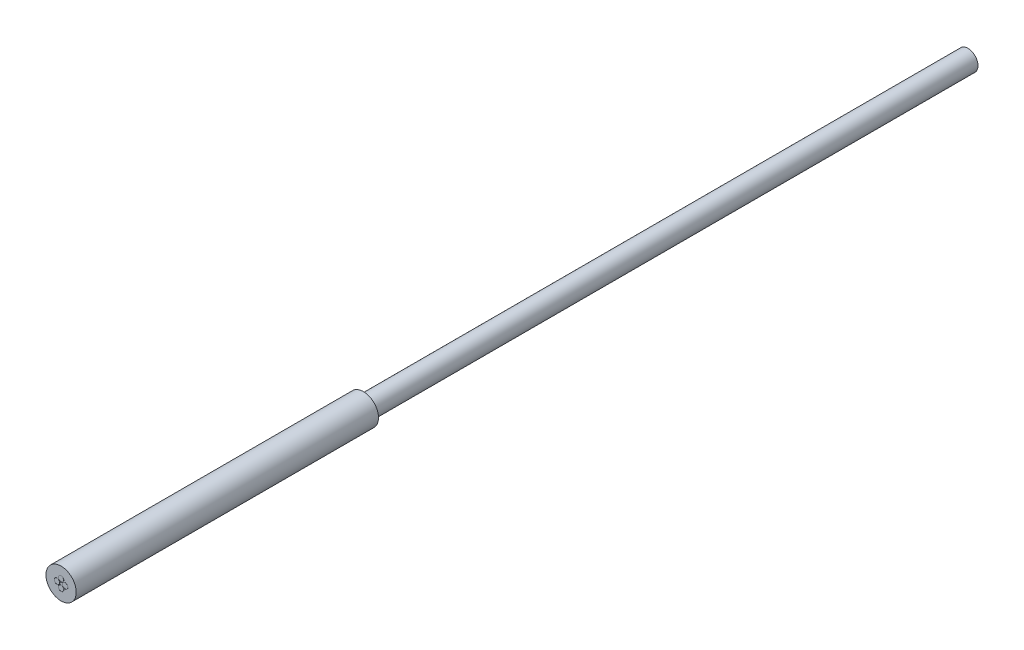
from build123d import *

# Parameters (mm, degrees)
SKETCH_1_R          = 0.75
EXTRUDE_1_DEPTH     = 15
SKETCH_2_R          = 0.5
EXTRUDE_2_DEPTH     = 30
SKETCH_3_R          = 0.1375
SKETCH_3_R_2        = 0.1325
CUT_EXTRUDE_1_DEPTH = 0.1


with BuildPart() as part:
    # Sketch 1 → Extrude 1 (new body)
    with BuildSketch(Plane.XY):
        Circle(SKETCH_1_R)
    extrude(amount=-EXTRUDE_1_DEPTH)

    # Sketch 2 → Extrude 2 (add)
    with BuildSketch(Plane(origin=(0, 0, -15), x_dir=(-1, 0, 0), z_dir=(0, 0, -1))):
        Circle(SKETCH_2_R)
    extrude(amount=EXTRUDE_2_DEPTH)

    # Sketch 3 → Cut-Extrude 1 (cut)
    # profile 1 of 4: a face of its own
    with BuildSketch(Plane.XY):
        with Locations((0, 0.201525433)):
            Circle(SKETCH_3_R)
        with Locations((0, 0.201525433)):
            Circle(SKETCH_3_R_2, mode=Mode.SUBTRACT)
    # profile 2 of 4: a face of its own
    with BuildSketch(Plane.XY):
        with Locations((0.201525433, 0)):
            Circle(SKETCH_3_R)
        with Locations((0.201525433, 0)):
            Circle(SKETCH_3_R_2, mode=Mode.SUBTRACT)
    # profile 3 of 4: a face of its own
    with BuildSketch(Plane.XY):
        with Locations((0, -0.201525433)):
            Circle(SKETCH_3_R)
        with Locations((0, -0.201525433)):
            Circle(SKETCH_3_R_2, mode=Mode.SUBTRACT)
    # profile 4 of 4: a face of its own
    with BuildSketch(Plane.XY):
        with Locations((-0.201525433, 0)):
            Circle(SKETCH_3_R)
        with Locations((-0.201525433, 0)):
            Circle(SKETCH_3_R_2, mode=Mode.SUBTRACT)
    extrude(amount=-CUT_EXTRUDE_1_DEPTH, mode=Mode.SUBTRACT)


solid = part.part
